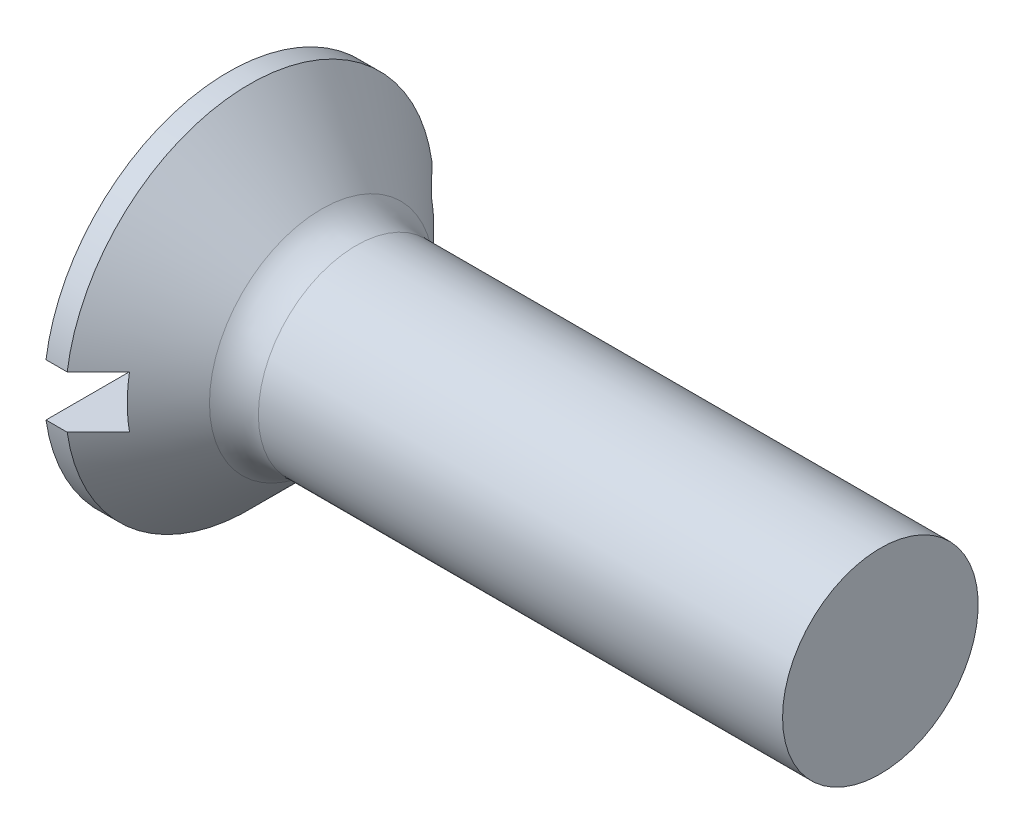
ISO-10303-21;
HEADER;
FILE_DESCRIPTION(('STEP AP214'),'2;1');
FILE_NAME('part.step','',(''),(''),'','','');
FILE_SCHEMA(('AUTOMOTIVE_DESIGN { 1 0 10303 214 1 1 1 1 }'));
ENDSEC;
DATA;
#1=APPLICATION_CONTEXT('core data for automotive mechanical design processes');
#2=APPLICATION_PROTOCOL_DEFINITION('international standard','automotive_design',2000,#1);
#3=PRODUCT_CONTEXT('',#1,'mechanical');
#4=PRODUCT('Part','Part','',(#3));
#5=PRODUCT_RELATED_PRODUCT_CATEGORY('part','',(#4));
#6=PRODUCT_DEFINITION_FORMATION('','',#4);
#7=PRODUCT_DEFINITION_CONTEXT('part definition',#1,'design');
#8=PRODUCT_DEFINITION('design','',#6,#7);
#9=PRODUCT_DEFINITION_SHAPE('','',#8);
#10=(LENGTH_UNIT() NAMED_UNIT(*) SI_UNIT(.MILLI.,.METRE.));
#11=(NAMED_UNIT(*) PLANE_ANGLE_UNIT() SI_UNIT($,.RADIAN.));
#12=(NAMED_UNIT(*) SI_UNIT($,.STERADIAN.) SOLID_ANGLE_UNIT());
#13=UNCERTAINTY_MEASURE_WITH_UNIT(LENGTH_MEASURE(1.E-05),#10,'distance_accuracy_value','');
#14=(GEOMETRIC_REPRESENTATION_CONTEXT(3) GLOBAL_UNCERTAINTY_ASSIGNED_CONTEXT((#13)) GLOBAL_UNIT_ASSIGNED_CONTEXT((#10,
#11,#12)) REPRESENTATION_CONTEXT('',''));
#15=CARTESIAN_POINT('',(0.,0.,0.));
#16=DIRECTION('',(0.,0.,1.));
#17=DIRECTION('',(1.,0.,0.));
#18=AXIS2_PLACEMENT_3D('',#15,#16,#17);
#19=CARTESIAN_POINT('',(0.,0.,0.));
#20=DIRECTION('',(-1.,0.,0.));
#21=DIRECTION('',(0.,0.,1.));
#22=AXIS2_PLACEMENT_3D('',#19,#20,#21);
#23=PLANE('',#22);
#24=DIRECTION('',(0.,0.,-1.));
#25=VECTOR('',#24,1.);
#26=CARTESIAN_POINT('',(0.,0.800000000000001,5.65));
#27=LINE('',#26,#25);
#28=CARTESIAN_POINT('',(0.,0.800000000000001,5.593076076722));
#29=VERTEX_POINT('',#28);
#30=CARTESIAN_POINT('',(0.,0.799999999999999,-5.593076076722));
#31=VERTEX_POINT('',#30);
#32=EDGE_CURVE('E169',#29,#31,#27,.T.);
#33=ORIENTED_EDGE('',*,*,#32,.F.);
#34=CARTESIAN_POINT('',(0.,0.,0.));
#35=DIRECTION('',(-1.,0.,0.));
#36=DIRECTION('',(0.,0.,1.));
#37=AXIS2_PLACEMENT_3D('',#34,#35,#36);
#38=CIRCLE('',#37,5.65);
#39=EDGE_CURVE('E113',#29,#31,#38,.T.);
#40=ORIENTED_EDGE('',*,*,#39,.T.);
#41=EDGE_LOOP('',(#33,#40));
#42=FACE_BOUND('',#41,.T.);
#43=ADVANCED_FACE('F32',(#42),#23,.T.);
#44=CARTESIAN_POINT('',(-6.34999999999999,0.,0.));
#45=DIRECTION('',(-1.,0.,0.));
#46=DIRECTION('',(0.,0.,1.));
#47=AXIS2_PLACEMENT_3D('',#44,#45,#46);
#48=CYLINDRICAL_SURFACE('',#47,5.65);
#49=DIRECTION('',(-1.,0.,0.));
#50=VECTOR('',#49,1.);
#51=CARTESIAN_POINT('',(-6.34999999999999,0.799999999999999,-5.593076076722));
#52=LINE('',#51,#50);
#53=CARTESIAN_POINT('',(0.650000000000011,0.799999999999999,-5.593076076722));
#54=VERTEX_POINT('',#53);
#55=EDGE_CURVE('E60',#31,#54,#52,.F.);
#56=ORIENTED_EDGE('',*,*,#55,.F.);
#57=ORIENTED_EDGE('',*,*,#39,.F.);
#58=DIRECTION('',(-1.,0.,0.));
#59=VECTOR('',#58,1.);
#60=CARTESIAN_POINT('',(-6.34999999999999,0.800000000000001,5.593076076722));
#61=LINE('',#60,#59);
#62=CARTESIAN_POINT('',(0.650000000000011,0.800000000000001,5.59307607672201));
#63=VERTEX_POINT('',#62);
#64=EDGE_CURVE('E175',#63,#29,#61,.T.);
#65=ORIENTED_EDGE('',*,*,#64,.F.);
#66=CARTESIAN_POINT('',(0.650000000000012,0.,0.));
#67=DIRECTION('',(-1.,0.,0.));
#68=DIRECTION('',(0.,0.,1.));
#69=AXIS2_PLACEMENT_3D('',#66,#67,#68);
#70=CIRCLE('',#69,5.65);
#71=EDGE_CURVE('E107',#63,#54,#70,.T.);
#72=ORIENTED_EDGE('',*,*,#71,.T.);
#73=EDGE_LOOP('',(#56,#57,#65,#72));
#74=FACE_BOUND('',#73,.T.);
#75=ADVANCED_FACE('F153',(#74),#48,.T.);
#76=DIRECTION('',(0.,0.,1.));
#77=VECTOR('',#76,1.);
#78=CARTESIAN_POINT('',(0.,-0.800000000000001,-5.65));
#79=LINE('',#78,#77);
#80=CARTESIAN_POINT('',(0.,-0.800000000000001,-5.593076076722));
#81=VERTEX_POINT('',#80);
#82=CARTESIAN_POINT('',(0.,-0.800000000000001,5.593076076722));
#83=VERTEX_POINT('',#82);
#84=EDGE_CURVE('E101',#81,#83,#79,.T.);
#85=ORIENTED_EDGE('',*,*,#84,.F.);
#86=EDGE_CURVE('E109',#81,#83,#38,.T.);
#87=ORIENTED_EDGE('',*,*,#86,.T.);
#88=EDGE_LOOP('',(#85,#87));
#89=FACE_BOUND('',#88,.T.);
#90=ADVANCED_FACE('F155',(#89),#23,.T.);
#91=DIRECTION('',(-1.,0.,0.));
#92=VECTOR('',#91,1.);
#93=CARTESIAN_POINT('',(-6.34999999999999,-0.800000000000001,5.593076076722));
#94=LINE('',#93,#92);
#95=CARTESIAN_POINT('',(0.650000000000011,-0.800000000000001,5.593076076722));
#96=VERTEX_POINT('',#95);
#97=EDGE_CURVE('E174',#83,#96,#94,.F.);
#98=ORIENTED_EDGE('',*,*,#97,.F.);
#99=ORIENTED_EDGE('',*,*,#86,.F.);
#100=DIRECTION('',(-1.,0.,0.));
#101=VECTOR('',#100,1.);
#102=CARTESIAN_POINT('',(-6.34999999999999,-0.800000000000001,-5.593076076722));
#103=LINE('',#102,#101);
#104=CARTESIAN_POINT('',(0.650000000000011,-0.800000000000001,-5.59307607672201));
#105=VERTEX_POINT('',#104);
#106=EDGE_CURVE('E172',#105,#81,#103,.T.);
#107=ORIENTED_EDGE('',*,*,#106,.F.);
#108=EDGE_CURVE('E110',#105,#96,#70,.T.);
#109=ORIENTED_EDGE('',*,*,#108,.T.);
#110=EDGE_LOOP('',(#98,#99,#107,#109));
#111=FACE_BOUND('',#110,.T.);
#112=ADVANCED_FACE('F150',(#111),#48,.T.);
#113=CARTESIAN_POINT('',(0.650000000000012,0.,0.));
#114=DIRECTION('',(-1.,0.,0.));
#115=DIRECTION('',(0.,0.,1.));
#116=AXIS2_PLACEMENT_3D('',#113,#114,#115);
#117=CONICAL_SURFACE('',#116,5.65,0.78539816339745);
#118=CARTESIAN_POINT('',(-6.15411798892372,0.799999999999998,-12.4283971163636));
#119=CARTESIAN_POINT('',(-5.72840936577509,0.799999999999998,-12.0018006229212));
#120=CARTESIAN_POINT('',(-5.30273955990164,0.799999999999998,-11.5751653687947));
#121=CARTESIAN_POINT('',(-4.45151919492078,0.799999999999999,-10.7217600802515));
#122=CARTESIAN_POINT('',(-4.0259686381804,0.799999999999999,-10.2949900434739));
#123=CARTESIAN_POINT('',(-3.17486613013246,0.799999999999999,-9.44109511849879));
#124=CARTESIAN_POINT('',(-2.74931425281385,0.799999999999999,-9.01397015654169));
#125=CARTESIAN_POINT('',(-1.89848797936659,0.799999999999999,-8.15945937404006));
#126=CARTESIAN_POINT('',(-1.47321357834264,0.799999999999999,-7.73207355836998));
#127=CARTESIAN_POINT('',(-0.615833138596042,0.799999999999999,-6.86957346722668));
#128=CARTESIAN_POINT('',(-0.183734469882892,0.799999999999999,-6.43445186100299));
#129=CARTESIAN_POINT('',(0.463821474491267,0.799999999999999,-5.78115808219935));
#130=CARTESIAN_POINT('',(0.679580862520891,0.799999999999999,-5.56328543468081));
#131=CARTESIAN_POINT('',(1.11080934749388,0.799999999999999,-5.12725542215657));
#132=CARTESIAN_POINT('',(1.32627844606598,0.799999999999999,-4.90909805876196));
#133=CARTESIAN_POINT('',(1.75673850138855,0.799999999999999,-4.4724245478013));
#134=CARTESIAN_POINT('',(1.9717295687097,0.799999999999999,-4.25390850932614));
#135=CARTESIAN_POINT('',(2.40105661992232,0.799999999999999,-3.81622451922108));
#136=CARTESIAN_POINT('',(2.61539258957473,0.799999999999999,-3.5970565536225));
#137=CARTESIAN_POINT('',(3.04295786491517,0.799999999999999,-3.15768240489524));
#138=CARTESIAN_POINT('',(3.25618727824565,0.8,-2.93747632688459));
#139=CARTESIAN_POINT('',(3.5744618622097,0.8,-2.60566790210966));
#140=CARTESIAN_POINT('',(3.68028997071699,0.8,-2.49481715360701));
#141=CARTESIAN_POINT('',(3.89117220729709,0.8,-2.27238250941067));
#142=CARTESIAN_POINT('',(3.9962263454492,0.8,-2.16079862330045));
#143=CARTESIAN_POINT('',(4.15723188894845,0.8,-1.98794766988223));
#144=CARTESIAN_POINT('',(4.2136059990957,0.8,-1.92707456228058));
#145=CARTESIAN_POINT('',(4.32589442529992,0.8,-1.80490303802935));
#146=CARTESIAN_POINT('',(4.38180873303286,0.8,-1.74360461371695));
#147=CARTESIAN_POINT('',(4.4929680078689,0.8,-1.62051315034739));
#148=CARTESIAN_POINT('',(4.54821358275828,0.8,-1.55872066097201));
#149=CARTESIAN_POINT('',(4.65786130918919,0.8,-1.43439270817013));
#150=CARTESIAN_POINT('',(4.71226349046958,0.8,-1.37185727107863));
#151=CARTESIAN_POINT('',(4.80409800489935,0.8,-1.26422341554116));
#152=CARTESIAN_POINT('',(4.84183289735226,0.8,-1.21938356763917));
#153=CARTESIAN_POINT('',(4.91649705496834,0.8,-1.12903902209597));
#154=CARTESIAN_POINT('',(4.9534263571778,0.8,-1.08353435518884));
#155=CARTESIAN_POINT('',(5.02626757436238,0.8,-0.991556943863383));
#156=CARTESIAN_POINT('',(5.06217715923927,0.8,-0.945082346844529));
#157=CARTESIAN_POINT('',(5.13244697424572,0.8,-0.850978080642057));
#158=CARTESIAN_POINT('',(5.16680749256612,0.8,-0.803348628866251));
#159=CARTESIAN_POINT('',(5.22431678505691,0.8,-0.719551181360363));
#160=CARTESIAN_POINT('',(5.24799439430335,0.8,-0.683748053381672));
#161=CARTESIAN_POINT('',(5.29369463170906,0.8,-0.611104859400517));
#162=CARTESIAN_POINT('',(5.31571771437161,0.8,-0.574265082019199));
#163=CARTESIAN_POINT('',(5.35744088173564,0.8,-0.499381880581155));
#164=CARTESIAN_POINT('',(5.3771460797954,0.8,-0.461341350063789));
#165=CARTESIAN_POINT('',(5.41336597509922,0.8,-0.383789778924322));
#166=CARTESIAN_POINT('',(5.42988361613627,0.8,-0.344280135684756));
#167=CARTESIAN_POINT('',(5.46094186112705,0.8,-0.256815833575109));
#168=CARTESIAN_POINT('',(5.47467792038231,0.8,-0.20856153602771));
#169=CARTESIAN_POINT('',(5.49381672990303,0.8,-0.110515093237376));
#170=CARTESIAN_POINT('',(5.49925037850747,0.8,-0.060729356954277));
#171=CARTESIAN_POINT('',(5.50060502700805,0.8,0.0392177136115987));
#172=CARTESIAN_POINT('',(5.49648099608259,0.8,0.0893797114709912));
#173=CARTESIAN_POINT('',(5.47960475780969,0.8,0.188284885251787));
#174=CARTESIAN_POINT('',(5.46682661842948,0.8,0.237023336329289));
#175=CARTESIAN_POINT('',(5.43411335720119,0.8,0.334650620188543));
#176=CARTESIAN_POINT('',(5.41385237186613,0.8,0.383425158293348));
#177=CARTESIAN_POINT('',(5.36862340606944,0.8,0.478778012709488));
#178=CARTESIAN_POINT('',(5.34364665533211,0.8,0.525352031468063));
#179=CARTESIAN_POINT('',(5.29038044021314,0.8,0.617035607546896));
#180=CARTESIAN_POINT('',(5.26206586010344,0.8,0.662130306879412));
#181=CARTESIAN_POINT('',(5.20333288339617,0.8,0.750853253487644));
#182=CARTESIAN_POINT('',(5.1729163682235,0.8,0.794482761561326));
#183=CARTESIAN_POINT('',(5.10778188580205,0.8,0.884555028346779));
#184=CARTESIAN_POINT('',(5.0729236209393,0.8,0.930895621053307));
#185=CARTESIAN_POINT('',(5.00196098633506,0.8,1.02261602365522));
#186=CARTESIAN_POINT('',(4.96585645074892,0.8,1.06799570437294));
#187=CARTESIAN_POINT('',(4.85617422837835,0.8,1.20309114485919));
#188=CARTESIAN_POINT('',(4.78126095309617,0.8,1.2917191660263));
#189=CARTESIAN_POINT('',(4.62929001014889,0.8,1.46737217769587));
#190=CARTESIAN_POINT('',(4.55222874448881,0.8,1.5543940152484));
#191=CARTESIAN_POINT('',(4.39684690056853,0.8,1.72725932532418));
#192=CARTESIAN_POINT('',(4.31852668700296,0.8,1.81310312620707));
#193=CARTESIAN_POINT('',(4.16128761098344,0.8,1.9837284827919));
#194=CARTESIAN_POINT('',(4.0823714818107,0.8,2.06851256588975));
#195=CARTESIAN_POINT('',(3.92393847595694,0.8,2.23752833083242));
#196=CARTESIAN_POINT('',(3.84442155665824,0.8,2.32175997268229));
#197=CARTESIAN_POINT('',(3.68503997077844,0.8,2.48972216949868));
#198=CARTESIAN_POINT('',(3.60517576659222,0.8,2.57345316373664));
#199=CARTESIAN_POINT('',(3.44512383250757,0.8,2.74060127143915));
#200=CARTESIAN_POINT('',(3.36493611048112,0.8,2.82401839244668));
#201=CARTESIAN_POINT('',(3.12470885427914,0.8,3.07317891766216));
#202=CARTESIAN_POINT('',(2.96430275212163,0.8,3.23856877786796));
#203=CARTESIAN_POINT('',(2.64287426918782,0.8,3.56874884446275));
#204=CARTESIAN_POINT('',(2.4818518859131,0.8,3.73353904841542));
#205=CARTESIAN_POINT('',(1.9981683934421,0.8,4.22731783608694));
#206=CARTESIAN_POINT('',(1.67489699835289,0.8,4.55570835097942));
#207=CARTESIAN_POINT('',(1.02739846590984,0.8,5.21181717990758));
#208=CARTESIAN_POINT('',(0.70317098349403,0.800000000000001,5.53953515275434));
#209=CARTESIAN_POINT('',(0.0542289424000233,0.800000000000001,6.1944827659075));
#210=CARTESIAN_POINT('',(-0.270485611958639,0.800000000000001,6.52171241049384));
#211=CARTESIAN_POINT('',(-0.920234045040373,0.800000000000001,7.17587674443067));
#212=CARTESIAN_POINT('',(-1.24526793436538,0.800000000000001,7.50281142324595));
#213=CARTESIAN_POINT('',(-1.8955454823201,0.800000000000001,8.15647358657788));
#214=CARTESIAN_POINT('',(-2.220789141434,0.800000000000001,8.48320107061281));
#215=CARTESIAN_POINT('',(-3.19666835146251,0.800000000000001,9.46309907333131));
#216=CARTESIAN_POINT('',(-3.84752047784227,0.800000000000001,10.1160538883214));
#217=CARTESIAN_POINT('',(-4.6364721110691,0.800000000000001,10.9071774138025));
#218=CARTESIAN_POINT('',(-4.77442315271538,0.800000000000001,11.0454942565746));
#219=CARTESIAN_POINT('',(-5.05034059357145,0.800000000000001,11.3221169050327));
#220=CARTESIAN_POINT('',(-5.18830699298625,0.800000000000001,11.4604227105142));
#221=CARTESIAN_POINT('',(-5.46424249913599,0.800000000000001,11.7370137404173));
#222=CARTESIAN_POINT('',(-5.60221160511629,0.800000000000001,11.8752989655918));
#223=CARTESIAN_POINT('',(-5.8781582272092,0.800000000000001,12.1518567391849));
#224=CARTESIAN_POINT('',(-6.01613574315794,0.800000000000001,12.2901292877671));
#225=CARTESIAN_POINT('',(-6.15411798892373,0.800000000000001,12.4283971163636));
#226=B_SPLINE_CURVE_WITH_KNOTS('',3,(#118,#119,#120,#121,#122,#123,#124,#125,#126,#127,#128,
#129,#130,#131,#132,#133,#134,#135,#136,#137,#138,#139,#140,#141,#142,#143,#144,#145,#146,#147,
#148,#149,#150,#151,#152,#153,#154,#155,#156,#157,#158,#159,#160,#161,#162,#163,#164,#165,#166,
#167,#168,#169,#170,#171,#172,#173,#174,#175,#176,#177,#178,#179,#180,#181,#182,#183,#184,#185,
#186,#187,#188,#189,#190,#191,#192,#193,#194,#195,#196,#197,#198,#199,#200,#201,#202,#203,#204,
#205,#206,#207,#208,#209,#210,#211,#212,#213,#214,#215,#216,#217,#218,#219,#220,#221,#222,#223,
#224,#225),.UNSPECIFIED.,.F.,.F.,(4,2,2,2,2,2,2,2,2,2,2,2,2,2,2,2,2,2,2,2,2,2,2,2,2,2,2,2,2,2,2,
2,2,2,2,2,2,2,2,2,2,2,2,2,2,2,2,2,2,2,2,2,2,4),(0.,1.80801318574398,3.61606002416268,
5.42486373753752,7.23363462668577,9.07329711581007,9.9931803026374,10.9130583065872,
11.8326950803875,12.7523517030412,13.6719171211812,14.1316838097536,14.5914445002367,
14.8403447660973,15.0892495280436,15.337907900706,15.5865574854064,15.7623655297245,
15.9381654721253,16.1143391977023,16.2904800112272,16.4192204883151,16.5479254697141,
16.6763409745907,16.8046373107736,16.9545930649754,17.1039893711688,17.2540909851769,
17.4046443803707,17.5627244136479,17.7211013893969,17.8807569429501,18.0402713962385,
18.2142039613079,18.3881597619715,18.7362365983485,19.0849364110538,19.4335369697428,
19.7810170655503,20.1285220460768,20.4756556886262,20.8227809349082,21.5139763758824,
22.2051746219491,23.5875972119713,24.9706017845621,26.3535941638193,27.7366341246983,
29.1196772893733,31.8854728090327,32.4715260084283,33.0575882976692,33.6436126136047,
34.2296278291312),.UNSPECIFIED.);
#227=CARTESIAN_POINT('',(1.6,0.8,4.63141447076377));
#228=VERTEX_POINT('',#227);
#229=EDGE_CURVE('E11',#228,#63,#226,.T.);
#230=ORIENTED_EDGE('',*,*,#229,.F.);
#231=CARTESIAN_POINT('',(1.6,0.,0.));
#232=DIRECTION('',(1.,0.,0.));
#233=DIRECTION('',(0.,0.,-1.));
#234=AXIS2_PLACEMENT_3D('',#231,#232,#233);
#235=CIRCLE('',#234,4.70000000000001);
#236=CARTESIAN_POINT('',(1.6,-0.800000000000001,4.63141447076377));
#237=VERTEX_POINT('',#236);
#238=EDGE_CURVE('E89',#237,#228,#235,.F.);
#239=ORIENTED_EDGE('',*,*,#238,.F.);
#240=CARTESIAN_POINT('',(-6.15411798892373,-0.800000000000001,12.4283971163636));
#241=CARTESIAN_POINT('',(-5.7284093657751,-0.800000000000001,12.0018006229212));
#242=CARTESIAN_POINT('',(-5.30273955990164,-0.800000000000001,11.5751653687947));
#243=CARTESIAN_POINT('',(-4.45151919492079,-0.800000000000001,10.7217600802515));
#244=CARTESIAN_POINT('',(-4.0259686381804,-0.800000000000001,10.2949900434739));
#245=CARTESIAN_POINT('',(-3.17486613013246,-0.800000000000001,9.4410951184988));
#246=CARTESIAN_POINT('',(-2.74931425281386,-0.800000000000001,9.0139701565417));
#247=CARTESIAN_POINT('',(-1.89848797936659,-0.800000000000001,8.15945937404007));
#248=CARTESIAN_POINT('',(-1.47321357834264,-0.800000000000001,7.73207355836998));
#249=CARTESIAN_POINT('',(-0.615833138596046,-0.800000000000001,6.86957346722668));
#250=CARTESIAN_POINT('',(-0.183734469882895,-0.800000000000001,6.434451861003));
#251=CARTESIAN_POINT('',(0.463821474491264,-0.800000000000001,5.78115808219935));
#252=CARTESIAN_POINT('',(0.679580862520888,-0.800000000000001,5.56328543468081));
#253=CARTESIAN_POINT('',(1.11080934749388,-0.800000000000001,5.12725542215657));
#254=CARTESIAN_POINT('',(1.32627844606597,-0.800000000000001,4.90909805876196));
#255=CARTESIAN_POINT('',(1.75673850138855,-0.800000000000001,4.4724245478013));
#256=CARTESIAN_POINT('',(1.9717295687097,-0.800000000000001,4.25390850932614));
#257=CARTESIAN_POINT('',(2.40105661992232,-0.800000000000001,3.81622451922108));
#258=CARTESIAN_POINT('',(2.61539258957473,-0.800000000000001,3.5970565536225));
#259=CARTESIAN_POINT('',(3.04295786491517,-0.800000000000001,3.15768240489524));
#260=CARTESIAN_POINT('',(3.25618727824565,-0.800000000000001,2.93747632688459));
#261=CARTESIAN_POINT('',(3.5744618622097,-0.800000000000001,2.60566790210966));
#262=CARTESIAN_POINT('',(3.68028997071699,-0.800000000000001,2.49481715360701));
#263=CARTESIAN_POINT('',(3.89117220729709,-0.800000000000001,2.27238250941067));
#264=CARTESIAN_POINT('',(3.9962263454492,-0.800000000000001,2.16079862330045));
#265=CARTESIAN_POINT('',(4.15723188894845,-0.800000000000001,1.98794766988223));
#266=CARTESIAN_POINT('',(4.2136059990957,-0.800000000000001,1.92707456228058));
#267=CARTESIAN_POINT('',(4.32589442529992,-0.800000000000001,1.80490303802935));
#268=CARTESIAN_POINT('',(4.38180873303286,-0.800000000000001,1.74360461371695));
#269=CARTESIAN_POINT('',(4.4929680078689,-0.800000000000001,1.62051315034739));
#270=CARTESIAN_POINT('',(4.54821358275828,-0.800000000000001,1.55872066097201));
#271=CARTESIAN_POINT('',(4.65786130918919,-0.800000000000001,1.43439270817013));
#272=CARTESIAN_POINT('',(4.71226349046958,-0.800000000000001,1.37185727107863));
#273=CARTESIAN_POINT('',(4.80409800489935,-0.800000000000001,1.26422341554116));
#274=CARTESIAN_POINT('',(4.84183289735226,-0.800000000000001,1.21938356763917));
#275=CARTESIAN_POINT('',(4.91649705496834,-0.800000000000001,1.12903902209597));
#276=CARTESIAN_POINT('',(4.9534263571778,-0.800000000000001,1.08353435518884));
#277=CARTESIAN_POINT('',(5.02626757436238,-0.800000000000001,0.991556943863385));
#278=CARTESIAN_POINT('',(5.06217715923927,-0.800000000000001,0.945082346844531));
#279=CARTESIAN_POINT('',(5.13244697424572,-0.800000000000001,0.850978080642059));
#280=CARTESIAN_POINT('',(5.16680749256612,-0.800000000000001,0.803348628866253));
#281=CARTESIAN_POINT('',(5.22431678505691,-0.800000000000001,0.719551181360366));
#282=CARTESIAN_POINT('',(5.24799439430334,-0.800000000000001,0.683748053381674));
#283=CARTESIAN_POINT('',(5.29369463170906,-0.800000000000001,0.61110485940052));
#284=CARTESIAN_POINT('',(5.31571771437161,-0.800000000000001,0.574265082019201));
#285=CARTESIAN_POINT('',(5.35744088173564,-0.800000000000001,0.499381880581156));
#286=CARTESIAN_POINT('',(5.3771460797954,-0.800000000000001,0.461341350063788));
#287=CARTESIAN_POINT('',(5.41336597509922,-0.800000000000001,0.38378977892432));
#288=CARTESIAN_POINT('',(5.42988361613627,-0.800000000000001,0.344280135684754));
#289=CARTESIAN_POINT('',(5.46094186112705,-0.800000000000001,0.256815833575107));
#290=CARTESIAN_POINT('',(5.47467792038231,-0.800000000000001,0.208561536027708));
#291=CARTESIAN_POINT('',(5.49381672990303,-0.800000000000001,0.110515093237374));
#292=CARTESIAN_POINT('',(5.49925037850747,-0.800000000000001,0.0607293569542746));
#293=CARTESIAN_POINT('',(5.50060502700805,-0.800000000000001,-0.0392177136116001));
#294=CARTESIAN_POINT('',(5.49648099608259,-0.800000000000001,-0.0893797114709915));
#295=CARTESIAN_POINT('',(5.47960475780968,-0.800000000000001,-0.188284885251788));
#296=CARTESIAN_POINT('',(5.46682661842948,-0.800000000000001,-0.237023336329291));
#297=CARTESIAN_POINT('',(5.43411335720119,-0.800000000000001,-0.334650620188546));
#298=CARTESIAN_POINT('',(5.41385237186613,-0.800000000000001,-0.383425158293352));
#299=CARTESIAN_POINT('',(5.36862340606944,-0.800000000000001,-0.478778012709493));
#300=CARTESIAN_POINT('',(5.34364665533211,-0.800000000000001,-0.525352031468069));
#301=CARTESIAN_POINT('',(5.29038044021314,-0.800000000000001,-0.617035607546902));
#302=CARTESIAN_POINT('',(5.26206586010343,-0.800000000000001,-0.662130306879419));
#303=CARTESIAN_POINT('',(5.20333288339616,-0.800000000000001,-0.750853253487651));
#304=CARTESIAN_POINT('',(5.1729163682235,-0.800000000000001,-0.794482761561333));
#305=CARTESIAN_POINT('',(5.10778188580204,-0.800000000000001,-0.884555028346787));
#306=CARTESIAN_POINT('',(5.07292362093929,-0.800000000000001,-0.930895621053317));
#307=CARTESIAN_POINT('',(5.00196098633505,-0.800000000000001,-1.02261602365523));
#308=CARTESIAN_POINT('',(4.96585645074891,-0.800000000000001,-1.06799570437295));
#309=CARTESIAN_POINT('',(4.85617422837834,-0.800000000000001,-1.2030911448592));
#310=CARTESIAN_POINT('',(4.78126095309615,-0.800000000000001,-1.29171916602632));
#311=CARTESIAN_POINT('',(4.62929001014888,-0.800000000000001,-1.46737217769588));
#312=CARTESIAN_POINT('',(4.55222874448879,-0.800000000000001,-1.55439401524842));
#313=CARTESIAN_POINT('',(4.39684690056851,-0.800000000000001,-1.7272593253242));
#314=CARTESIAN_POINT('',(4.31852668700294,-0.800000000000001,-1.81310312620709));
#315=CARTESIAN_POINT('',(4.16128761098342,-0.800000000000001,-1.98372848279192));
#316=CARTESIAN_POINT('',(4.08237148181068,-0.800000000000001,-2.06851256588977));
#317=CARTESIAN_POINT('',(3.92393847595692,-0.800000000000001,-2.23752833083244));
#318=CARTESIAN_POINT('',(3.84442155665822,-0.800000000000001,-2.32175997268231));
#319=CARTESIAN_POINT('',(3.68503997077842,-0.800000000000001,-2.48972216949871));
#320=CARTESIAN_POINT('',(3.60517576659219,-0.800000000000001,-2.57345316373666));
#321=CARTESIAN_POINT('',(3.44512383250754,-0.800000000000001,-2.74060127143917));
#322=CARTESIAN_POINT('',(3.36493611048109,-0.800000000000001,-2.82401839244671));
#323=CARTESIAN_POINT('',(3.12470885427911,-0.800000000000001,-3.07317891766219));
#324=CARTESIAN_POINT('',(2.9643027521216,-0.800000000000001,-3.238568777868));
#325=CARTESIAN_POINT('',(2.64287426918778,-0.800000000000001,-3.56874884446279));
#326=CARTESIAN_POINT('',(2.48185188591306,-0.800000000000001,-3.73353904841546));
#327=CARTESIAN_POINT('',(1.99816839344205,-0.800000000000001,-4.22731783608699));
#328=CARTESIAN_POINT('',(1.67489699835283,-0.800000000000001,-4.55570835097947));
#329=CARTESIAN_POINT('',(1.02739846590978,-0.800000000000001,-5.21181717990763));
#330=CARTESIAN_POINT('',(0.703170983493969,-0.800000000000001,-5.5395351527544));
#331=CARTESIAN_POINT('',(0.0542289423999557,-0.800000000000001,-6.19448276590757));
#332=CARTESIAN_POINT('',(-0.270485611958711,-0.800000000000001,-6.52171241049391));
#333=CARTESIAN_POINT('',(-0.920234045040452,-0.800000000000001,-7.17587674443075));
#334=CARTESIAN_POINT('',(-1.24526793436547,-0.800000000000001,-7.50281142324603));
#335=CARTESIAN_POINT('',(-1.89554548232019,-0.800000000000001,-8.15647358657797));
#336=CARTESIAN_POINT('',(-2.22078914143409,-0.800000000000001,-8.48320107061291));
#337=CARTESIAN_POINT('',(-3.19666835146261,-0.800000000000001,-9.46309907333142));
#338=CARTESIAN_POINT('',(-3.84752047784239,-0.800000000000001,-10.1160538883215));
#339=CARTESIAN_POINT('',(-4.63647211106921,-0.800000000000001,-10.9071774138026));
#340=CARTESIAN_POINT('',(-4.77442315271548,-0.800000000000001,-11.0454942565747));
#341=CARTESIAN_POINT('',(-5.05034059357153,-0.800000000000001,-11.3221169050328));
#342=CARTESIAN_POINT('',(-5.18830699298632,-0.800000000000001,-11.4604227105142));
#343=CARTESIAN_POINT('',(-5.46424249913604,-0.800000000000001,-11.7370137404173));
#344=CARTESIAN_POINT('',(-5.60221160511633,-0.800000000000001,-11.8752989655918));
#345=CARTESIAN_POINT('',(-5.87815822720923,-0.800000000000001,-12.151856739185));
#346=CARTESIAN_POINT('',(-6.01613574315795,-0.800000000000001,-12.2901292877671));
#347=CARTESIAN_POINT('',(-6.15411798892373,-0.800000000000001,-12.4283971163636));
#348=B_SPLINE_CURVE_WITH_KNOTS('',3,(#240,#241,#242,#243,#244,#245,#246,#247,#248,#249,#250,
#251,#252,#253,#254,#255,#256,#257,#258,#259,#260,#261,#262,#263,#264,#265,#266,#267,#268,#269,
#270,#271,#272,#273,#274,#275,#276,#277,#278,#279,#280,#281,#282,#283,#284,#285,#286,#287,#288,
#289,#290,#291,#292,#293,#294,#295,#296,#297,#298,#299,#300,#301,#302,#303,#304,#305,#306,#307,
#308,#309,#310,#311,#312,#313,#314,#315,#316,#317,#318,#319,#320,#321,#322,#323,#324,#325,#326,
#327,#328,#329,#330,#331,#332,#333,#334,#335,#336,#337,#338,#339,#340,#341,#342,#343,#344,#345,
#346,#347),.UNSPECIFIED.,.F.,.F.,(4,2,2,2,2,2,2,2,2,2,2,2,2,2,2,2,2,2,2,2,2,2,2,2,2,2,2,2,2,2,2,
2,2,2,2,2,2,2,2,2,2,2,2,2,2,2,2,2,2,2,2,2,2,4),(0.,1.80801318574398,3.61606002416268,
5.42486373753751,7.23363462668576,9.07329711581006,9.99318030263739,10.9130583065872,
11.8326950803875,12.7523517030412,13.6719171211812,14.1316838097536,14.5914445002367,
14.8403447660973,15.0892495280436,15.337907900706,15.5865574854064,15.7623655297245,
15.9381654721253,16.1143391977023,16.2904800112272,16.4192204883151,16.5479254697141,
16.6763409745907,16.8046373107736,16.9545930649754,17.1039893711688,17.2540909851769,
17.4046443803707,17.5627244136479,17.7211013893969,17.8807569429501,18.0402713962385,
18.2142039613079,18.3881597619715,18.7362365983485,19.0849364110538,19.4335369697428,
19.7810170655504,20.1285220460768,20.4756556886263,20.8227809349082,21.5139763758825,
22.2051746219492,23.5875972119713,24.9706017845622,26.3535941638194,27.7366341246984,
29.1196772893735,31.8854728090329,32.4715260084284,33.0575882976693,33.6436126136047,
34.2296278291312),.UNSPECIFIED.);
#349=EDGE_CURVE('E46',#96,#237,#348,.T.);
#350=ORIENTED_EDGE('',*,*,#349,.F.);
#351=ORIENTED_EDGE('',*,*,#108,.F.);
#352=CARTESIAN_POINT('',(1.6,-0.800000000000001,-4.63141447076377));
#353=VERTEX_POINT('',#352);
#354=EDGE_CURVE('E125',#353,#105,#348,.T.);
#355=ORIENTED_EDGE('',*,*,#354,.F.);
#356=CARTESIAN_POINT('',(1.6,0.799999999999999,-4.63141447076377));
#357=VERTEX_POINT('',#356);
#358=EDGE_CURVE('E97',#357,#353,#235,.F.);
#359=ORIENTED_EDGE('',*,*,#358,.F.);
#360=EDGE_CURVE('E36',#54,#357,#226,.T.);
#361=ORIENTED_EDGE('',*,*,#360,.F.);
#362=ORIENTED_EDGE('',*,*,#71,.F.);
#363=EDGE_LOOP('',(#230,#239,#350,#351,#355,#359,#361,#362));
#364=FACE_BOUND('',#363,.T.);
#365=CARTESIAN_POINT('',(2.86066017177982,0.,0.));
#366=DIRECTION('',(-1.,0.,0.));
#367=DIRECTION('',(0.,0.,1.));
#368=AXIS2_PLACEMENT_3D('',#365,#366,#367);
#369=CIRCLE('',#368,3.43933982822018);
#370=CARTESIAN_POINT('',(2.86066017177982,0.,3.43933982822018));
#371=VERTEX_POINT('',#370);
#372=EDGE_CURVE('E120',#371,#371,#369,.T.);
#373=ORIENTED_EDGE('',*,*,#372,.T.);
#374=EDGE_LOOP('',(#373));
#375=FACE_BOUND('',#374,.T.);
#376=ADVANCED_FACE('F104',(#364,#375),#117,.T.);
#377=CARTESIAN_POINT('',(-6.34999999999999,0.,0.));
#378=DIRECTION('',(-1.,0.,0.));
#379=DIRECTION('',(0.,0.,1.));
#380=AXIS2_PLACEMENT_3D('',#377,#378,#379);
#381=CYLINDRICAL_SURFACE('',#380,3.);
#382=CARTESIAN_POINT('',(3.92132034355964,0.,0.));
#383=DIRECTION('',(-1.,0.,0.));
#384=DIRECTION('',(0.,0.,1.));
#385=AXIS2_PLACEMENT_3D('',#382,#383,#384);
#386=CIRCLE('',#385,3.);
#387=CARTESIAN_POINT('',(3.92132034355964,0.,3.));
#388=VERTEX_POINT('',#387);
#389=EDGE_CURVE('E123',#388,#388,#386,.F.);
#390=ORIENTED_EDGE('',*,*,#389,.T.);
#391=EDGE_LOOP('',(#390));
#392=FACE_BOUND('',#391,.T.);
#393=CARTESIAN_POINT('',(20.,0.,0.));
#394=DIRECTION('',(-1.,0.,0.));
#395=DIRECTION('',(0.,0.,1.));
#396=AXIS2_PLACEMENT_3D('',#393,#394,#395);
#397=CIRCLE('',#396,3.);
#398=CARTESIAN_POINT('',(20.,0.,3.));
#399=VERTEX_POINT('',#398);
#400=EDGE_CURVE('E116',#399,#399,#397,.T.);
#401=ORIENTED_EDGE('',*,*,#400,.T.);
#402=EDGE_LOOP('',(#401));
#403=FACE_BOUND('',#402,.T.);
#404=ADVANCED_FACE('F143',(#392,#403),#381,.T.);
#405=CARTESIAN_POINT('',(20.,3.,0.));
#406=DIRECTION('',(1.,0.,0.));
#407=DIRECTION('',(0.,0.,-1.));
#408=AXIS2_PLACEMENT_3D('',#405,#406,#407);
#409=PLANE('',#408);
#410=ORIENTED_EDGE('',*,*,#400,.F.);
#411=EDGE_LOOP('',(#410));
#412=FACE_BOUND('',#411,.T.);
#413=ADVANCED_FACE('F141',(#412),#409,.T.);
#414=CARTESIAN_POINT('',(3.92132034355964,0.,0.));
#415=DIRECTION('',(-1.,0.,0.));
#416=DIRECTION('',(0.,0.,1.));
#417=AXIS2_PLACEMENT_3D('',#414,#415,#416);
#418=TOROIDAL_SURFACE('',#417,4.5,1.5);
#419=ORIENTED_EDGE('',*,*,#389,.F.);
#420=EDGE_LOOP('',(#419));
#421=FACE_BOUND('',#420,.T.);
#422=ORIENTED_EDGE('',*,*,#372,.F.);
#423=EDGE_LOOP('',(#422));
#424=FACE_BOUND('',#423,.T.);
#425=ADVANCED_FACE('F34',(#421,#424),#418,.F.);
#426=CARTESIAN_POINT('',(1.6,0.800000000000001,5.65));
#427=DIRECTION('',(0.,1.,0.));
#428=DIRECTION('',(0.,0.,1.));
#429=AXIS2_PLACEMENT_3D('',#426,#427,#428);
#430=PLANE('',#429);
#431=ORIENTED_EDGE('',*,*,#55,.T.);
#432=ORIENTED_EDGE('',*,*,#360,.T.);
#433=DIRECTION('',(0.,0.,-1.));
#434=VECTOR('',#433,1.);
#435=CARTESIAN_POINT('',(1.6,0.800000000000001,5.65));
#436=LINE('',#435,#434);
#437=EDGE_CURVE('E53',#228,#357,#436,.T.);
#438=ORIENTED_EDGE('',*,*,#437,.F.);
#439=ORIENTED_EDGE('',*,*,#229,.T.);
#440=ORIENTED_EDGE('',*,*,#64,.T.);
#441=ORIENTED_EDGE('',*,*,#32,.T.);
#442=EDGE_LOOP('',(#431,#432,#438,#439,#440,#441));
#443=FACE_BOUND('',#442,.T.);
#444=ADVANCED_FACE('F98',(#443),#430,.F.);
#445=CARTESIAN_POINT('',(1.6,-0.800000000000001,-5.65));
#446=DIRECTION('',(0.,-1.,0.));
#447=DIRECTION('',(0.,0.,-1.));
#448=AXIS2_PLACEMENT_3D('',#445,#446,#447);
#449=PLANE('',#448);
#450=ORIENTED_EDGE('',*,*,#97,.T.);
#451=ORIENTED_EDGE('',*,*,#349,.T.);
#452=DIRECTION('',(0.,0.,1.));
#453=VECTOR('',#452,1.);
#454=CARTESIAN_POINT('',(1.6,-0.800000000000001,-5.65));
#455=LINE('',#454,#453);
#456=EDGE_CURVE('E92',#353,#237,#455,.T.);
#457=ORIENTED_EDGE('',*,*,#456,.F.);
#458=ORIENTED_EDGE('',*,*,#354,.T.);
#459=ORIENTED_EDGE('',*,*,#106,.T.);
#460=ORIENTED_EDGE('',*,*,#84,.T.);
#461=EDGE_LOOP('',(#450,#451,#457,#458,#459,#460));
#462=FACE_BOUND('',#461,.T.);
#463=ADVANCED_FACE('F133',(#462),#449,.F.);
#464=CARTESIAN_POINT('',(1.6,-0.800000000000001,-5.65));
#465=DIRECTION('',(1.,0.,0.));
#466=DIRECTION('',(0.,0.,-1.));
#467=AXIS2_PLACEMENT_3D('',#464,#465,#466);
#468=PLANE('',#467);
#469=ORIENTED_EDGE('',*,*,#238,.T.);
#470=ORIENTED_EDGE('',*,*,#437,.T.);
#471=ORIENTED_EDGE('',*,*,#358,.T.);
#472=ORIENTED_EDGE('',*,*,#456,.T.);
#473=EDGE_LOOP('',(#469,#470,#471,#472));
#474=FACE_BOUND('',#473,.T.);
#475=ADVANCED_FACE('F90',(#474),#468,.F.);
#476=CLOSED_SHELL('',(#43,#75,#90,#112,#376,#404,#413,#425,#444,#463,#475));
#477=MANIFOLD_SOLID_BREP('B2',#476);
#478=ADVANCED_BREP_SHAPE_REPRESENTATION('',(#18,#477),#14);
#479=SHAPE_DEFINITION_REPRESENTATION(#9,#478);
ENDSEC;
END-ISO-10303-21;
